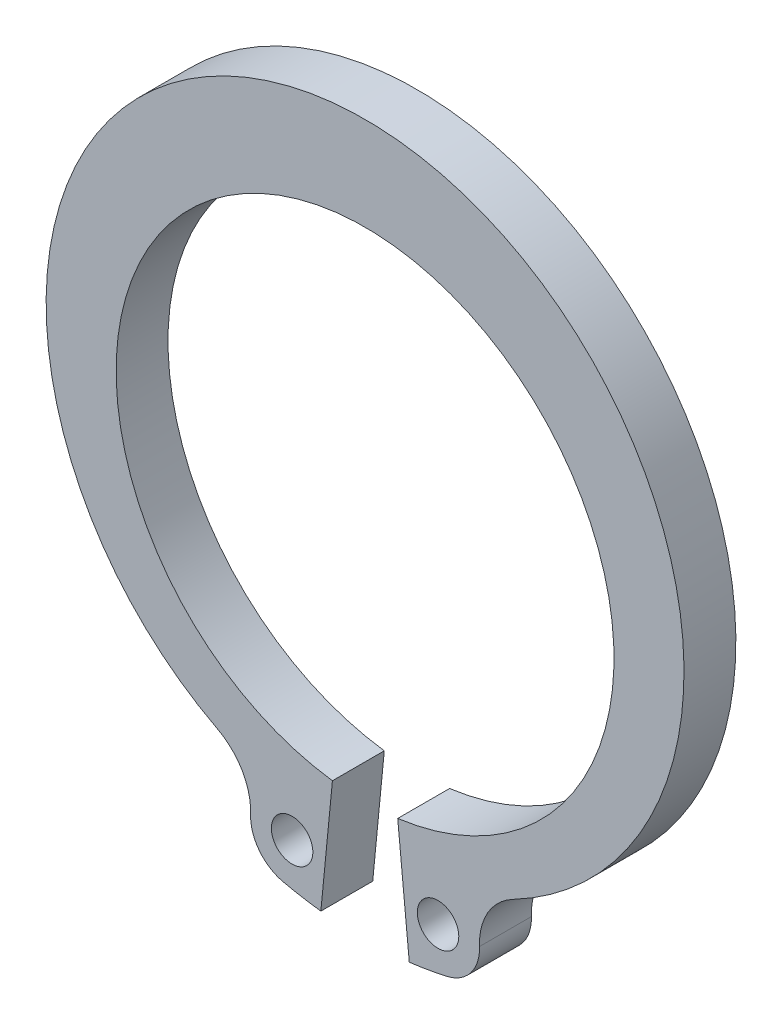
ISO-10303-21;
HEADER;
FILE_DESCRIPTION(('STEP AP214'),'2;1');
FILE_NAME('part.step','',(''),(''),'','','');
FILE_SCHEMA(('AUTOMOTIVE_DESIGN { 1 0 10303 214 1 1 1 1 }'));
ENDSEC;
DATA;
#1=APPLICATION_CONTEXT('core data for automotive mechanical design processes');
#2=APPLICATION_PROTOCOL_DEFINITION('international standard','automotive_design',2000,#1);
#3=PRODUCT_CONTEXT('',#1,'mechanical');
#4=PRODUCT('Part','Part','',(#3));
#5=PRODUCT_RELATED_PRODUCT_CATEGORY('part','',(#4));
#6=PRODUCT_DEFINITION_FORMATION('','',#4);
#7=PRODUCT_DEFINITION_CONTEXT('part definition',#1,'design');
#8=PRODUCT_DEFINITION('design','',#6,#7);
#9=PRODUCT_DEFINITION_SHAPE('','',#8);
#10=(LENGTH_UNIT() NAMED_UNIT(*) SI_UNIT(.MILLI.,.METRE.));
#11=(NAMED_UNIT(*) PLANE_ANGLE_UNIT() SI_UNIT($,.RADIAN.));
#12=(NAMED_UNIT(*) SI_UNIT($,.STERADIAN.) SOLID_ANGLE_UNIT());
#13=UNCERTAINTY_MEASURE_WITH_UNIT(LENGTH_MEASURE(1.E-05),#10,'distance_accuracy_value','');
#14=(GEOMETRIC_REPRESENTATION_CONTEXT(3) GLOBAL_UNCERTAINTY_ASSIGNED_CONTEXT((#13)) GLOBAL_UNIT_ASSIGNED_CONTEXT((#10,
#11,#12)) REPRESENTATION_CONTEXT('',''));
#15=CARTESIAN_POINT('',(0.,0.,0.));
#16=DIRECTION('',(0.,0.,1.));
#17=DIRECTION('',(1.,0.,0.));
#18=AXIS2_PLACEMENT_3D('',#15,#16,#17);
#19=CARTESIAN_POINT('',(0.,0.,1.));
#20=DIRECTION('',(0.,0.,1.));
#21=DIRECTION('',(1.,0.,0.));
#22=AXIS2_PLACEMENT_3D('',#19,#20,#21);
#23=PLANE('',#22);
#24=CARTESIAN_POINT('',(-1.40703478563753,-6.13992277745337,1.));
#25=DIRECTION('',(0.,0.,1.));
#26=DIRECTION('',(-1.,0.,0.));
#27=AXIS2_PLACEMENT_3D('',#24,#25,#26);
#28=CIRCLE('',#27,0.4);
#29=CARTESIAN_POINT('',(-1.80703478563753,-6.13992277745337,1.));
#30=VERTEX_POINT('',#29);
#31=EDGE_CURVE('E126',#30,#30,#28,.T.);
#32=ORIENTED_EDGE('',*,*,#31,.F.);
#33=EDGE_LOOP('',(#32));
#34=FACE_BOUND('',#33,.T.);
#35=CARTESIAN_POINT('',(0.,0.,1.));
#36=DIRECTION('',(0.,0.,-1.));
#37=DIRECTION('',(1.,0.,0.));
#38=AXIS2_PLACEMENT_3D('',#35,#36,#37);
#39=CIRCLE('',#38,4.8);
#40=CARTESIAN_POINT('',(-0.629452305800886,-4.75854912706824,1.));
#41=VERTEX_POINT('',#40);
#42=CARTESIAN_POINT('',(0.629452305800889,-4.75854912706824,1.));
#43=VERTEX_POINT('',#42);
#44=EDGE_CURVE('E148',#41,#43,#39,.T.);
#45=ORIENTED_EDGE('',*,*,#44,.T.);
#46=DIRECTION('',(0.0969467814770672,-0.995289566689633,0.));
#47=VECTOR('',#46,1.);
#48=CARTESIAN_POINT('',(0.629452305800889,-4.75854912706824,1.));
#49=LINE('',#48,#47);
#50=CARTESIAN_POINT('',(0.85242990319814,-7.0477151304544,1.));
#51=VERTEX_POINT('',#50);
#52=EDGE_CURVE('E121',#43,#51,#49,.T.);
#53=ORIENTED_EDGE('',*,*,#52,.T.);
#54=CARTESIAN_POINT('',(0.,0.,1.));
#55=DIRECTION('',(0.,0.,1.));
#56=DIRECTION('',(1.,0.,0.));
#57=AXIS2_PLACEMENT_3D('',#54,#55,#56);
#58=CIRCLE('',#57,7.09907918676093);
#59=CARTESIAN_POINT('',(1.58573198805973,-6.91970948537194,1.));
#60=VERTEX_POINT('',#59);
#61=EDGE_CURVE('E151',#51,#60,#58,.T.);
#62=ORIENTED_EDGE('',*,*,#61,.T.);
#63=CARTESIAN_POINT('',(1.40703478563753,-6.13992277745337,1.));
#64=DIRECTION('',(0.,0.,1.));
#65=DIRECTION('',(1.,0.,0.));
#66=AXIS2_PLACEMENT_3D('',#63,#64,#65);
#67=CIRCLE('',#66,0.8);
#68=CARTESIAN_POINT('',(2.20644924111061,-6.10932002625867,1.));
#69=VERTEX_POINT('',#68);
#70=EDGE_CURVE('E153',#60,#69,#67,.T.);
#71=ORIENTED_EDGE('',*,*,#70,.T.);
#72=CARTESIAN_POINT('',(3.40557092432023,-6.06341589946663,1.));
#73=DIRECTION('',(0.,0.,-1.));
#74=DIRECTION('',(1.,0.,0.));
#75=AXIS2_PLACEMENT_3D('',#72,#73,#74);
#76=CIRCLE('',#75,1.2);
#77=CARTESIAN_POINT('',(2.84955934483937,-5.00000105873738,1.));
#78=VERTEX_POINT('',#77);
#79=EDGE_CURVE('E155',#69,#78,#76,.T.);
#80=ORIENTED_EDGE('',*,*,#79,.T.);
#81=CARTESIAN_POINT('',(0.,0.45,1.));
#82=DIRECTION('',(0.,0.,1.));
#83=DIRECTION('',(1.,0.,0.));
#84=AXIS2_PLACEMENT_3D('',#81,#82,#83);
#85=CIRCLE('',#84,6.15);
#86=CARTESIAN_POINT('',(-2.84955934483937,-5.00000105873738,1.));
#87=VERTEX_POINT('',#86);
#88=EDGE_CURVE('E157',#78,#87,#85,.T.);
#89=ORIENTED_EDGE('',*,*,#88,.T.);
#90=CARTESIAN_POINT('',(-3.40557092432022,-6.06341589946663,1.));
#91=DIRECTION('',(0.,0.,-1.));
#92=DIRECTION('',(-1.,0.,0.));
#93=AXIS2_PLACEMENT_3D('',#90,#91,#92);
#94=CIRCLE('',#93,1.2);
#95=CARTESIAN_POINT('',(-2.20644924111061,-6.10932002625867,1.));
#96=VERTEX_POINT('',#95);
#97=EDGE_CURVE('E159',#87,#96,#94,.T.);
#98=ORIENTED_EDGE('',*,*,#97,.T.);
#99=CARTESIAN_POINT('',(-1.40703478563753,-6.13992277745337,1.));
#100=DIRECTION('',(0.,0.,1.));
#101=DIRECTION('',(-1.,0.,0.));
#102=AXIS2_PLACEMENT_3D('',#99,#100,#101);
#103=CIRCLE('',#102,0.8);
#104=CARTESIAN_POINT('',(-1.58573198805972,-6.91970948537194,1.));
#105=VERTEX_POINT('',#104);
#106=EDGE_CURVE('E161',#96,#105,#103,.T.);
#107=ORIENTED_EDGE('',*,*,#106,.T.);
#108=CARTESIAN_POINT('',(0.,0.,1.));
#109=DIRECTION('',(0.,0.,1.));
#110=DIRECTION('',(-1.,0.,0.));
#111=AXIS2_PLACEMENT_3D('',#108,#109,#110);
#112=CIRCLE('',#111,7.09907918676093);
#113=CARTESIAN_POINT('',(-0.85242990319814,-7.0477151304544,1.));
#114=VERTEX_POINT('',#113);
#115=EDGE_CURVE('E50',#105,#114,#112,.T.);
#116=ORIENTED_EDGE('',*,*,#115,.T.);
#117=DIRECTION('',(0.096946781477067,0.995289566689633,0.));
#118=VECTOR('',#117,1.);
#119=CARTESIAN_POINT('',(-0.629452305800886,-4.75854912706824,1.));
#120=LINE('',#119,#118);
#121=EDGE_CURVE('E45',#114,#41,#120,.T.);
#122=ORIENTED_EDGE('',*,*,#121,.T.);
#123=EDGE_LOOP('',(#45,#53,#62,#71,#80,#89,#98,#107,#116,#122));
#124=FACE_BOUND('',#123,.T.);
#125=CARTESIAN_POINT('',(1.40703478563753,-6.13992277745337,1.));
#126=DIRECTION('',(0.,0.,1.));
#127=DIRECTION('',(1.,0.,0.));
#128=AXIS2_PLACEMENT_3D('',#125,#126,#127);
#129=CIRCLE('',#128,0.4);
#130=CARTESIAN_POINT('',(1.80703478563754,-6.13992277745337,1.));
#131=VERTEX_POINT('',#130);
#132=EDGE_CURVE('E248',#131,#131,#129,.T.);
#133=ORIENTED_EDGE('',*,*,#132,.F.);
#134=EDGE_LOOP('',(#133));
#135=FACE_BOUND('',#134,.T.);
#136=ADVANCED_FACE('F30',(#34,#124,#135),#23,.T.);
#137=CARTESIAN_POINT('',(0.,0.,0.));
#138=DIRECTION('',(0.,0.,1.));
#139=DIRECTION('',(1.,0.,0.));
#140=AXIS2_PLACEMENT_3D('',#137,#138,#139);
#141=PLANE('',#140);
#142=CARTESIAN_POINT('',(-1.40703478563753,-6.13992277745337,0.));
#143=DIRECTION('',(0.,0.,1.));
#144=DIRECTION('',(-1.,0.,0.));
#145=AXIS2_PLACEMENT_3D('',#142,#143,#144);
#146=CIRCLE('',#145,0.4);
#147=CARTESIAN_POINT('',(-1.80703478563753,-6.13992277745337,0.));
#148=VERTEX_POINT('',#147);
#149=EDGE_CURVE('E129',#148,#148,#146,.T.);
#150=ORIENTED_EDGE('',*,*,#149,.T.);
#151=EDGE_LOOP('',(#150));
#152=FACE_BOUND('',#151,.T.);
#153=CARTESIAN_POINT('',(0.,0.,0.));
#154=DIRECTION('',(0.,0.,-1.));
#155=DIRECTION('',(1.,0.,0.));
#156=AXIS2_PLACEMENT_3D('',#153,#154,#155);
#157=CIRCLE('',#156,4.8);
#158=CARTESIAN_POINT('',(-0.629452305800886,-4.75854912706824,0.));
#159=VERTEX_POINT('',#158);
#160=CARTESIAN_POINT('',(0.629452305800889,-4.75854912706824,0.));
#161=VERTEX_POINT('',#160);
#162=EDGE_CURVE('E112',#159,#161,#157,.T.);
#163=ORIENTED_EDGE('',*,*,#162,.F.);
#164=DIRECTION('',(0.096946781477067,0.995289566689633,0.));
#165=VECTOR('',#164,1.);
#166=CARTESIAN_POINT('',(-0.629452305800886,-4.75854912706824,0.));
#167=LINE('',#166,#165);
#168=CARTESIAN_POINT('',(-0.85242990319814,-7.0477151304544,0.));
#169=VERTEX_POINT('',#168);
#170=EDGE_CURVE('E146',#169,#159,#167,.T.);
#171=ORIENTED_EDGE('',*,*,#170,.F.);
#172=CARTESIAN_POINT('',(0.,0.,0.));
#173=DIRECTION('',(0.,0.,1.));
#174=DIRECTION('',(-1.,0.,0.));
#175=AXIS2_PLACEMENT_3D('',#172,#173,#174);
#176=CIRCLE('',#175,7.09907918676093);
#177=CARTESIAN_POINT('',(-1.58573198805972,-6.91970948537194,0.));
#178=VERTEX_POINT('',#177);
#179=EDGE_CURVE('E144',#178,#169,#176,.T.);
#180=ORIENTED_EDGE('',*,*,#179,.F.);
#181=CARTESIAN_POINT('',(-1.40703478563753,-6.13992277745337,0.));
#182=DIRECTION('',(0.,0.,1.));
#183=DIRECTION('',(-1.,0.,0.));
#184=AXIS2_PLACEMENT_3D('',#181,#182,#183);
#185=CIRCLE('',#184,0.8);
#186=CARTESIAN_POINT('',(-2.20644924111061,-6.10932002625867,0.));
#187=VERTEX_POINT('',#186);
#188=EDGE_CURVE('E142',#187,#178,#185,.T.);
#189=ORIENTED_EDGE('',*,*,#188,.F.);
#190=CARTESIAN_POINT('',(-3.40557092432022,-6.06341589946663,0.));
#191=DIRECTION('',(0.,0.,-1.));
#192=DIRECTION('',(-1.,0.,0.));
#193=AXIS2_PLACEMENT_3D('',#190,#191,#192);
#194=CIRCLE('',#193,1.2);
#195=CARTESIAN_POINT('',(-2.84955934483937,-5.00000105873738,0.));
#196=VERTEX_POINT('',#195);
#197=EDGE_CURVE('E140',#196,#187,#194,.T.);
#198=ORIENTED_EDGE('',*,*,#197,.F.);
#199=CARTESIAN_POINT('',(0.,0.45,0.));
#200=DIRECTION('',(0.,0.,1.));
#201=DIRECTION('',(1.,0.,0.));
#202=AXIS2_PLACEMENT_3D('',#199,#200,#201);
#203=CIRCLE('',#202,6.15);
#204=CARTESIAN_POINT('',(2.84955934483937,-5.00000105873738,0.));
#205=VERTEX_POINT('',#204);
#206=EDGE_CURVE('E138',#205,#196,#203,.T.);
#207=ORIENTED_EDGE('',*,*,#206,.F.);
#208=CARTESIAN_POINT('',(3.40557092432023,-6.06341589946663,0.));
#209=DIRECTION('',(0.,0.,-1.));
#210=DIRECTION('',(1.,0.,0.));
#211=AXIS2_PLACEMENT_3D('',#208,#209,#210);
#212=CIRCLE('',#211,1.2);
#213=CARTESIAN_POINT('',(2.20644924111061,-6.10932002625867,0.));
#214=VERTEX_POINT('',#213);
#215=EDGE_CURVE('E136',#214,#205,#212,.T.);
#216=ORIENTED_EDGE('',*,*,#215,.F.);
#217=CARTESIAN_POINT('',(1.40703478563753,-6.13992277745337,0.));
#218=DIRECTION('',(0.,0.,1.));
#219=DIRECTION('',(1.,0.,0.));
#220=AXIS2_PLACEMENT_3D('',#217,#218,#219);
#221=CIRCLE('',#220,0.8);
#222=CARTESIAN_POINT('',(1.58573198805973,-6.91970948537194,0.));
#223=VERTEX_POINT('',#222);
#224=EDGE_CURVE('E134',#223,#214,#221,.T.);
#225=ORIENTED_EDGE('',*,*,#224,.F.);
#226=CARTESIAN_POINT('',(0.,0.,0.));
#227=DIRECTION('',(0.,0.,1.));
#228=DIRECTION('',(1.,0.,0.));
#229=AXIS2_PLACEMENT_3D('',#226,#227,#228);
#230=CIRCLE('',#229,7.09907918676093);
#231=CARTESIAN_POINT('',(0.85242990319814,-7.0477151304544,0.));
#232=VERTEX_POINT('',#231);
#233=EDGE_CURVE('E114',#232,#223,#230,.T.);
#234=ORIENTED_EDGE('',*,*,#233,.F.);
#235=DIRECTION('',(0.0969467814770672,-0.995289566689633,0.));
#236=VECTOR('',#235,1.);
#237=CARTESIAN_POINT('',(0.629452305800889,-4.75854912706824,0.));
#238=LINE('',#237,#236);
#239=EDGE_CURVE('E107',#161,#232,#238,.T.);
#240=ORIENTED_EDGE('',*,*,#239,.F.);
#241=EDGE_LOOP('',(#163,#171,#180,#189,#198,#207,#216,#225,#234,#240));
#242=FACE_BOUND('',#241,.T.);
#243=CARTESIAN_POINT('',(1.40703478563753,-6.13992277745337,0.));
#244=DIRECTION('',(0.,0.,1.));
#245=DIRECTION('',(1.,0.,0.));
#246=AXIS2_PLACEMENT_3D('',#243,#244,#245);
#247=CIRCLE('',#246,0.4);
#248=CARTESIAN_POINT('',(1.80703478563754,-6.13992277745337,0.));
#249=VERTEX_POINT('',#248);
#250=EDGE_CURVE('E251',#249,#249,#247,.T.);
#251=ORIENTED_EDGE('',*,*,#250,.T.);
#252=EDGE_LOOP('',(#251));
#253=FACE_BOUND('',#252,.T.);
#254=ADVANCED_FACE('F108',(#152,#242,#253),#141,.F.);
#255=CARTESIAN_POINT('',(0.,0.,1.));
#256=DIRECTION('',(0.,0.,-1.));
#257=DIRECTION('',(-1.,0.,0.));
#258=AXIS2_PLACEMENT_3D('',#255,#256,#257);
#259=CYLINDRICAL_SURFACE('',#258,4.8);
#260=ORIENTED_EDGE('',*,*,#162,.T.);
#261=DIRECTION('',(0.,0.,-1.));
#262=VECTOR('',#261,1.);
#263=CARTESIAN_POINT('',(0.629452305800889,-4.75854912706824,1.));
#264=LINE('',#263,#262);
#265=EDGE_CURVE('E11',#43,#161,#264,.T.);
#266=ORIENTED_EDGE('',*,*,#265,.F.);
#267=ORIENTED_EDGE('',*,*,#44,.F.);
#268=DIRECTION('',(0.,0.,-1.));
#269=VECTOR('',#268,1.);
#270=CARTESIAN_POINT('',(-0.629452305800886,-4.75854912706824,1.));
#271=LINE('',#270,#269);
#272=EDGE_CURVE('E125',#41,#159,#271,.T.);
#273=ORIENTED_EDGE('',*,*,#272,.T.);
#274=EDGE_LOOP('',(#260,#266,#267,#273));
#275=FACE_BOUND('',#274,.T.);
#276=ADVANCED_FACE('F32',(#275),#259,.F.);
#277=CARTESIAN_POINT('',(0.629452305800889,-4.75854912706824,1.));
#278=DIRECTION('',(0.995289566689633,0.0969467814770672,0.));
#279=DIRECTION('',(-0.0969467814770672,0.995289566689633,0.));
#280=AXIS2_PLACEMENT_3D('',#277,#278,#279);
#281=PLANE('',#280);
#282=ORIENTED_EDGE('',*,*,#239,.T.);
#283=DIRECTION('',(0.,0.,-1.));
#284=VECTOR('',#283,1.);
#285=CARTESIAN_POINT('',(0.85242990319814,-7.0477151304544,1.));
#286=LINE('',#285,#284);
#287=EDGE_CURVE('E38',#51,#232,#286,.T.);
#288=ORIENTED_EDGE('',*,*,#287,.F.);
#289=ORIENTED_EDGE('',*,*,#52,.F.);
#290=ORIENTED_EDGE('',*,*,#265,.T.);
#291=EDGE_LOOP('',(#282,#288,#289,#290));
#292=FACE_BOUND('',#291,.T.);
#293=ADVANCED_FACE('F120',(#292),#281,.F.);
#294=CARTESIAN_POINT('',(0.,0.,1.));
#295=DIRECTION('',(0.,0.,-1.));
#296=DIRECTION('',(-1.,0.,0.));
#297=AXIS2_PLACEMENT_3D('',#294,#295,#296);
#298=CYLINDRICAL_SURFACE('',#297,7.09907918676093);
#299=ORIENTED_EDGE('',*,*,#233,.T.);
#300=DIRECTION('',(0.,0.,-1.));
#301=VECTOR('',#300,1.);
#302=CARTESIAN_POINT('',(1.58573198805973,-6.91970948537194,1.));
#303=LINE('',#302,#301);
#304=EDGE_CURVE('E184',#60,#223,#303,.T.);
#305=ORIENTED_EDGE('',*,*,#304,.F.);
#306=ORIENTED_EDGE('',*,*,#61,.F.);
#307=ORIENTED_EDGE('',*,*,#287,.T.);
#308=EDGE_LOOP('',(#299,#305,#306,#307));
#309=FACE_BOUND('',#308,.T.);
#310=ADVANCED_FACE('F188',(#309),#298,.T.);
#311=CARTESIAN_POINT('',(1.40703478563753,-6.13992277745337,1.));
#312=DIRECTION('',(0.,0.,-1.));
#313=DIRECTION('',(-1.,0.,0.));
#314=AXIS2_PLACEMENT_3D('',#311,#312,#313);
#315=CYLINDRICAL_SURFACE('',#314,0.8);
#316=ORIENTED_EDGE('',*,*,#224,.T.);
#317=DIRECTION('',(0.,0.,-1.));
#318=VECTOR('',#317,1.);
#319=CARTESIAN_POINT('',(2.20644924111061,-6.10932002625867,1.));
#320=LINE('',#319,#318);
#321=EDGE_CURVE('E181',#69,#214,#320,.T.);
#322=ORIENTED_EDGE('',*,*,#321,.F.);
#323=ORIENTED_EDGE('',*,*,#70,.F.);
#324=ORIENTED_EDGE('',*,*,#304,.T.);
#325=EDGE_LOOP('',(#316,#322,#323,#324));
#326=FACE_BOUND('',#325,.T.);
#327=ADVANCED_FACE('F196',(#326),#315,.T.);
#328=CARTESIAN_POINT('',(3.40557092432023,-6.06341589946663,1.));
#329=DIRECTION('',(0.,0.,-1.));
#330=DIRECTION('',(-1.,0.,0.));
#331=AXIS2_PLACEMENT_3D('',#328,#329,#330);
#332=CYLINDRICAL_SURFACE('',#331,1.2);
#333=ORIENTED_EDGE('',*,*,#215,.T.);
#334=DIRECTION('',(0.,0.,-1.));
#335=VECTOR('',#334,1.);
#336=CARTESIAN_POINT('',(2.84955934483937,-5.00000105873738,1.));
#337=LINE('',#336,#335);
#338=EDGE_CURVE('E178',#78,#205,#337,.T.);
#339=ORIENTED_EDGE('',*,*,#338,.F.);
#340=ORIENTED_EDGE('',*,*,#79,.F.);
#341=ORIENTED_EDGE('',*,*,#321,.T.);
#342=EDGE_LOOP('',(#333,#339,#340,#341));
#343=FACE_BOUND('',#342,.T.);
#344=ADVANCED_FACE('F199',(#343),#332,.F.);
#345=CARTESIAN_POINT('',(0.,0.45,1.));
#346=DIRECTION('',(0.,0.,-1.));
#347=DIRECTION('',(-1.,0.,0.));
#348=AXIS2_PLACEMENT_3D('',#345,#346,#347);
#349=CYLINDRICAL_SURFACE('',#348,6.15);
#350=ORIENTED_EDGE('',*,*,#206,.T.);
#351=DIRECTION('',(0.,0.,-1.));
#352=VECTOR('',#351,1.);
#353=CARTESIAN_POINT('',(-2.84955934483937,-5.00000105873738,1.));
#354=LINE('',#353,#352);
#355=EDGE_CURVE('E175',#87,#196,#354,.T.);
#356=ORIENTED_EDGE('',*,*,#355,.F.);
#357=ORIENTED_EDGE('',*,*,#88,.F.);
#358=ORIENTED_EDGE('',*,*,#338,.T.);
#359=EDGE_LOOP('',(#350,#356,#357,#358));
#360=FACE_BOUND('',#359,.T.);
#361=ADVANCED_FACE('F204',(#360),#349,.T.);
#362=CARTESIAN_POINT('',(-3.40557092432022,-6.06341589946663,1.));
#363=DIRECTION('',(0.,0.,-1.));
#364=DIRECTION('',(-1.,0.,0.));
#365=AXIS2_PLACEMENT_3D('',#362,#363,#364);
#366=CYLINDRICAL_SURFACE('',#365,1.2);
#367=ORIENTED_EDGE('',*,*,#197,.T.);
#368=DIRECTION('',(0.,0.,-1.));
#369=VECTOR('',#368,1.);
#370=CARTESIAN_POINT('',(-2.20644924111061,-6.10932002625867,1.));
#371=LINE('',#370,#369);
#372=EDGE_CURVE('E172',#96,#187,#371,.T.);
#373=ORIENTED_EDGE('',*,*,#372,.F.);
#374=ORIENTED_EDGE('',*,*,#97,.F.);
#375=ORIENTED_EDGE('',*,*,#355,.T.);
#376=EDGE_LOOP('',(#367,#373,#374,#375));
#377=FACE_BOUND('',#376,.T.);
#378=ADVANCED_FACE('F210',(#377),#366,.F.);
#379=CARTESIAN_POINT('',(-1.40703478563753,-6.13992277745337,1.));
#380=DIRECTION('',(0.,0.,-1.));
#381=DIRECTION('',(-1.,0.,0.));
#382=AXIS2_PLACEMENT_3D('',#379,#380,#381);
#383=CYLINDRICAL_SURFACE('',#382,0.8);
#384=ORIENTED_EDGE('',*,*,#188,.T.);
#385=DIRECTION('',(0.,0.,-1.));
#386=VECTOR('',#385,1.);
#387=CARTESIAN_POINT('',(-1.58573198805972,-6.91970948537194,1.));
#388=LINE('',#387,#386);
#389=EDGE_CURVE('E169',#105,#178,#388,.T.);
#390=ORIENTED_EDGE('',*,*,#389,.F.);
#391=ORIENTED_EDGE('',*,*,#106,.F.);
#392=ORIENTED_EDGE('',*,*,#372,.T.);
#393=EDGE_LOOP('',(#384,#390,#391,#392));
#394=FACE_BOUND('',#393,.T.);
#395=ADVANCED_FACE('F214',(#394),#383,.T.);
#396=CARTESIAN_POINT('',(0.,0.,1.));
#397=DIRECTION('',(0.,0.,-1.));
#398=DIRECTION('',(-1.,0.,0.));
#399=AXIS2_PLACEMENT_3D('',#396,#397,#398);
#400=CYLINDRICAL_SURFACE('',#399,7.09907918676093);
#401=ORIENTED_EDGE('',*,*,#179,.T.);
#402=DIRECTION('',(0.,0.,-1.));
#403=VECTOR('',#402,1.);
#404=CARTESIAN_POINT('',(-0.85242990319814,-7.0477151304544,1.));
#405=LINE('',#404,#403);
#406=EDGE_CURVE('E166',#114,#169,#405,.T.);
#407=ORIENTED_EDGE('',*,*,#406,.F.);
#408=ORIENTED_EDGE('',*,*,#115,.F.);
#409=ORIENTED_EDGE('',*,*,#389,.T.);
#410=EDGE_LOOP('',(#401,#407,#408,#409));
#411=FACE_BOUND('',#410,.T.);
#412=ADVANCED_FACE('F217',(#411),#400,.T.);
#413=CARTESIAN_POINT('',(-0.629452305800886,-4.75854912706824,1.));
#414=DIRECTION('',(-0.995289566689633,0.096946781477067,0.));
#415=DIRECTION('',(-0.096946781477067,-0.995289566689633,0.));
#416=AXIS2_PLACEMENT_3D('',#413,#414,#415);
#417=PLANE('',#416);
#418=ORIENTED_EDGE('',*,*,#170,.T.);
#419=ORIENTED_EDGE('',*,*,#272,.F.);
#420=ORIENTED_EDGE('',*,*,#121,.F.);
#421=ORIENTED_EDGE('',*,*,#406,.T.);
#422=EDGE_LOOP('',(#418,#419,#420,#421));
#423=FACE_BOUND('',#422,.T.);
#424=ADVANCED_FACE('F219',(#423),#417,.F.);
#425=CARTESIAN_POINT('',(-1.40703478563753,-6.13992277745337,1.));
#426=DIRECTION('',(0.,0.,-1.));
#427=DIRECTION('',(-1.,0.,0.));
#428=AXIS2_PLACEMENT_3D('',#425,#426,#427);
#429=CYLINDRICAL_SURFACE('',#428,0.4);
#430=ORIENTED_EDGE('',*,*,#31,.T.);
#431=EDGE_LOOP('',(#430));
#432=FACE_BOUND('',#431,.T.);
#433=ORIENTED_EDGE('',*,*,#149,.F.);
#434=EDGE_LOOP('',(#433));
#435=FACE_BOUND('',#434,.T.);
#436=ADVANCED_FACE('F221',(#432,#435),#429,.F.);
#437=CARTESIAN_POINT('',(1.40703478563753,-6.13992277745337,1.));
#438=DIRECTION('',(0.,0.,-1.));
#439=DIRECTION('',(-1.,0.,0.));
#440=AXIS2_PLACEMENT_3D('',#437,#438,#439);
#441=CYLINDRICAL_SURFACE('',#440,0.4);
#442=ORIENTED_EDGE('',*,*,#132,.T.);
#443=EDGE_LOOP('',(#442));
#444=FACE_BOUND('',#443,.T.);
#445=ORIENTED_EDGE('',*,*,#250,.F.);
#446=EDGE_LOOP('',(#445));
#447=FACE_BOUND('',#446,.T.);
#448=ADVANCED_FACE('F227',(#444,#447),#441,.F.);
#449=CLOSED_SHELL('',(#136,#254,#276,#293,#310,#327,#344,#361,#378,#395,#412,#424,#436,#448));
#450=MANIFOLD_SOLID_BREP('B2',#449);
#451=ADVANCED_BREP_SHAPE_REPRESENTATION('',(#18,#450),#14);
#452=SHAPE_DEFINITION_REPRESENTATION(#9,#451);
ENDSEC;
END-ISO-10303-21;
